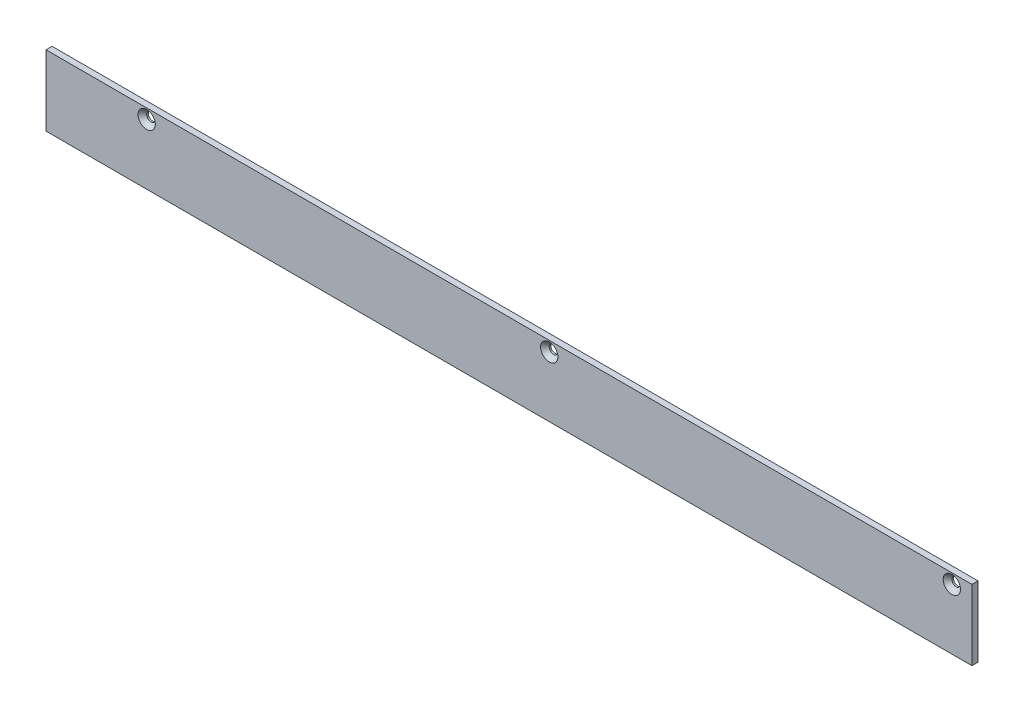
ISO-10303-21;
HEADER;
FILE_DESCRIPTION(('STEP AP214'),'2;1');
FILE_NAME('part.step','',(''),(''),'','','');
FILE_SCHEMA(('AUTOMOTIVE_DESIGN { 1 0 10303 214 1 1 1 1 }'));
ENDSEC;
DATA;
#1=APPLICATION_CONTEXT('core data for automotive mechanical design processes');
#2=APPLICATION_PROTOCOL_DEFINITION('international standard','automotive_design',2000,#1);
#3=PRODUCT_CONTEXT('',#1,'mechanical');
#4=PRODUCT('Part','Part','',(#3));
#5=PRODUCT_RELATED_PRODUCT_CATEGORY('part','',(#4));
#6=PRODUCT_DEFINITION_FORMATION('','',#4);
#7=PRODUCT_DEFINITION_CONTEXT('part definition',#1,'design');
#8=PRODUCT_DEFINITION('design','',#6,#7);
#9=PRODUCT_DEFINITION_SHAPE('','',#8);
#10=(LENGTH_UNIT() NAMED_UNIT(*) SI_UNIT(.MILLI.,.METRE.));
#11=(NAMED_UNIT(*) PLANE_ANGLE_UNIT() SI_UNIT($,.RADIAN.));
#12=(NAMED_UNIT(*) SI_UNIT($,.STERADIAN.) SOLID_ANGLE_UNIT());
#13=UNCERTAINTY_MEASURE_WITH_UNIT(LENGTH_MEASURE(1.E-05),#10,'distance_accuracy_value','');
#14=(GEOMETRIC_REPRESENTATION_CONTEXT(3) GLOBAL_UNCERTAINTY_ASSIGNED_CONTEXT((#13)) GLOBAL_UNIT_ASSIGNED_CONTEXT((#10,
#11,#12)) REPRESENTATION_CONTEXT('',''));
#15=CARTESIAN_POINT('',(0.,0.,0.));
#16=DIRECTION('',(0.,0.,1.));
#17=DIRECTION('',(1.,0.,0.));
#18=AXIS2_PLACEMENT_3D('',#15,#16,#17);
#19=CARTESIAN_POINT('',(4.44089209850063E-13,-1.80411241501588E-13,3.00000000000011));
#20=DIRECTION('',(1.,0.,0.));
#21=DIRECTION('',(0.,0.,-1.00000000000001));
#22=AXIS2_PLACEMENT_3D('',#19,#20,#21);
#23=PLANE('',#22);
#24=DIRECTION('',(0.,-1.,0.));
#25=VECTOR('',#24,1.);
#26=CARTESIAN_POINT('',(0.,0.,0.));
#27=LINE('',#26,#25);
#28=CARTESIAN_POINT('',(0.,34.9999999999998,1.11022302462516E-13));
#29=VERTEX_POINT('',#28);
#30=CARTESIAN_POINT('',(0.,0.,0.));
#31=VERTEX_POINT('',#30);
#32=EDGE_CURVE('E100',#29,#31,#27,.T.);
#33=ORIENTED_EDGE('',*,*,#32,.T.);
#34=DIRECTION('',(0.,0.,-1.00000000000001));
#35=VECTOR('',#34,1.);
#36=CARTESIAN_POINT('',(4.44089209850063E-13,-1.80411241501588E-13,3.00000000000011));
#37=LINE('',#36,#35);
#38=CARTESIAN_POINT('',(4.44089209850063E-13,-1.80411241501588E-13,3.00000000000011));
#39=VERTEX_POINT('',#38);
#40=EDGE_CURVE('E11',#39,#31,#37,.T.);
#41=ORIENTED_EDGE('',*,*,#40,.F.);
#42=DIRECTION('',(0.,-1.,0.));
#43=VECTOR('',#42,1.);
#44=CARTESIAN_POINT('',(4.44089209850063E-13,-1.80411241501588E-13,3.00000000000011));
#45=LINE('',#44,#43);
#46=CARTESIAN_POINT('',(-1.11022302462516E-12,35.0000000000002,3.00000000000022));
#47=VERTEX_POINT('',#46);
#48=EDGE_CURVE('E88',#47,#39,#45,.T.);
#49=ORIENTED_EDGE('',*,*,#48,.F.);
#50=DIRECTION('',(0.,0.,-1.00000000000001));
#51=VECTOR('',#50,1.);
#52=CARTESIAN_POINT('',(-1.11022302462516E-12,35.0000000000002,3.00000000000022));
#53=LINE('',#52,#51);
#54=EDGE_CURVE('E96',#47,#29,#53,.T.);
#55=ORIENTED_EDGE('',*,*,#54,.T.);
#56=EDGE_LOOP('',(#33,#41,#49,#55));
#57=FACE_BOUND('',#56,.T.);
#58=ADVANCED_FACE('F36',(#57),#23,.F.);
#59=CARTESIAN_POINT('',(4.44089209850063E-13,-1.80411241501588E-13,3.00000000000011));
#60=DIRECTION('',(0.,1.,0.));
#61=DIRECTION('',(0.,0.,1.00000000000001));
#62=AXIS2_PLACEMENT_3D('',#59,#60,#61);
#63=PLANE('',#62);
#64=DIRECTION('',(1.,0.,0.));
#65=VECTOR('',#64,1.);
#66=CARTESIAN_POINT('',(0.,0.,0.));
#67=LINE('',#66,#65);
#68=CARTESIAN_POINT('',(459.999999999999,0.,-1.11022302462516E-13));
#69=VERTEX_POINT('',#68);
#70=EDGE_CURVE('E92',#31,#69,#67,.T.);
#71=ORIENTED_EDGE('',*,*,#70,.T.);
#72=DIRECTION('',(0.,0.,-1.00000000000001));
#73=VECTOR('',#72,1.);
#74=CARTESIAN_POINT('',(460.,0.,3.));
#75=LINE('',#74,#73);
#76=CARTESIAN_POINT('',(460.,0.,3.));
#77=VERTEX_POINT('',#76);
#78=EDGE_CURVE('E45',#77,#69,#75,.T.);
#79=ORIENTED_EDGE('',*,*,#78,.F.);
#80=DIRECTION('',(1.,0.,0.));
#81=VECTOR('',#80,1.);
#82=CARTESIAN_POINT('',(4.44089209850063E-13,-1.80411241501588E-13,3.00000000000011));
#83=LINE('',#82,#81);
#84=EDGE_CURVE('E83',#39,#77,#83,.T.);
#85=ORIENTED_EDGE('',*,*,#84,.F.);
#86=ORIENTED_EDGE('',*,*,#40,.T.);
#87=EDGE_LOOP('',(#71,#79,#85,#86));
#88=FACE_BOUND('',#87,.T.);
#89=ADVANCED_FACE('F91',(#88),#63,.F.);
#90=CARTESIAN_POINT('',(460.,0.,3.));
#91=DIRECTION('',(-1.,0.,0.));
#92=DIRECTION('',(0.,0.,1.00000000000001));
#93=AXIS2_PLACEMENT_3D('',#90,#91,#92);
#94=PLANE('',#93);
#95=DIRECTION('',(0.,1.,0.));
#96=VECTOR('',#95,1.);
#97=CARTESIAN_POINT('',(459.999999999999,0.,-1.11022302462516E-13));
#98=LINE('',#97,#96);
#99=CARTESIAN_POINT('',(460.,35.0000000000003,1.11022302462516E-12));
#100=VERTEX_POINT('',#99);
#101=EDGE_CURVE('E70',#69,#100,#98,.T.);
#102=ORIENTED_EDGE('',*,*,#101,.T.);
#103=DIRECTION('',(0.,0.,-1.00000000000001));
#104=VECTOR('',#103,1.);
#105=CARTESIAN_POINT('',(459.999999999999,35.0000000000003,2.99999999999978));
#106=LINE('',#105,#104);
#107=CARTESIAN_POINT('',(459.999999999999,35.0000000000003,2.99999999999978));
#108=VERTEX_POINT('',#107);
#109=EDGE_CURVE('E93',#108,#100,#106,.T.);
#110=ORIENTED_EDGE('',*,*,#109,.F.);
#111=DIRECTION('',(0.,1.,0.));
#112=VECTOR('',#111,1.);
#113=CARTESIAN_POINT('',(460.,0.,3.));
#114=LINE('',#113,#112);
#115=EDGE_CURVE('E86',#77,#108,#114,.T.);
#116=ORIENTED_EDGE('',*,*,#115,.F.);
#117=ORIENTED_EDGE('',*,*,#78,.T.);
#118=EDGE_LOOP('',(#102,#110,#116,#117));
#119=FACE_BOUND('',#118,.T.);
#120=ADVANCED_FACE('F94',(#119),#94,.F.);
#121=CARTESIAN_POINT('',(-1.11022302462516E-12,35.0000000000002,3.00000000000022));
#122=DIRECTION('',(0.,-1.,0.));
#123=DIRECTION('',(0.,0.,-1.00000000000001));
#124=AXIS2_PLACEMENT_3D('',#121,#122,#123);
#125=PLANE('',#124);
#126=DIRECTION('',(-1.,0.,0.));
#127=VECTOR('',#126,1.);
#128=CARTESIAN_POINT('',(0.,34.9999999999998,1.11022302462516E-13));
#129=LINE('',#128,#127);
#130=EDGE_CURVE('E76',#100,#29,#129,.T.);
#131=ORIENTED_EDGE('',*,*,#130,.T.);
#132=ORIENTED_EDGE('',*,*,#54,.F.);
#133=DIRECTION('',(-1.,0.,0.));
#134=VECTOR('',#133,1.);
#135=CARTESIAN_POINT('',(-1.11022302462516E-12,35.0000000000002,3.00000000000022));
#136=LINE('',#135,#134);
#137=EDGE_CURVE('E53',#108,#47,#136,.T.);
#138=ORIENTED_EDGE('',*,*,#137,.F.);
#139=ORIENTED_EDGE('',*,*,#109,.T.);
#140=EDGE_LOOP('',(#131,#132,#138,#139));
#141=FACE_BOUND('',#140,.T.);
#142=ADVANCED_FACE('F108',(#141),#125,.F.);
#143=CARTESIAN_POINT('',(4.44089209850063E-13,-1.80411241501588E-13,3.00000000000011));
#144=DIRECTION('',(0.,0.,-1.00000000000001));
#145=DIRECTION('',(-1.,0.,0.));
#146=AXIS2_PLACEMENT_3D('',#143,#144,#145);
#147=PLANE('',#146);
#148=CARTESIAN_POINT('',(49.9999999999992,30.,2.99999999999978));
#149=DIRECTION('',(0.,0.,1.00000000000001));
#150=DIRECTION('',(1.,0.,0.));
#151=AXIS2_PLACEMENT_3D('',#148,#149,#150);
#152=CIRCLE('',#151,4.3);
#153=CARTESIAN_POINT('',(54.2999999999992,30.,2.99999999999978));
#154=VERTEX_POINT('',#153);
#155=EDGE_CURVE('E103',#154,#154,#152,.T.);
#156=ORIENTED_EDGE('',*,*,#155,.F.);
#157=EDGE_LOOP('',(#156));
#158=FACE_BOUND('',#157,.T.);
#159=CARTESIAN_POINT('',(249.999999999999,30.0000000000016,3.00000000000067));
#160=DIRECTION('',(0.,0.,1.00000000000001));
#161=DIRECTION('',(1.,0.,0.));
#162=AXIS2_PLACEMENT_3D('',#159,#160,#161);
#163=CIRCLE('',#162,4.30000000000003);
#164=CARTESIAN_POINT('',(254.299999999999,30.0000000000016,3.00000000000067));
#165=VERTEX_POINT('',#164);
#166=EDGE_CURVE('E117',#165,#165,#163,.T.);
#167=ORIENTED_EDGE('',*,*,#166,.F.);
#168=EDGE_LOOP('',(#167));
#169=FACE_BOUND('',#168,.T.);
#170=CARTESIAN_POINT('',(449.999999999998,30.0000000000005,3.000000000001));
#171=DIRECTION('',(0.,0.,1.00000000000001));
#172=DIRECTION('',(1.,0.,0.));
#173=AXIS2_PLACEMENT_3D('',#170,#171,#172);
#174=CIRCLE('',#173,4.29999999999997);
#175=CARTESIAN_POINT('',(454.299999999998,30.0000000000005,3.000000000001));
#176=VERTEX_POINT('',#175);
#177=EDGE_CURVE('E114',#176,#176,#174,.T.);
#178=ORIENTED_EDGE('',*,*,#177,.F.);
#179=EDGE_LOOP('',(#178));
#180=FACE_BOUND('',#179,.T.);
#181=ORIENTED_EDGE('',*,*,#48,.T.);
#182=ORIENTED_EDGE('',*,*,#84,.T.);
#183=ORIENTED_EDGE('',*,*,#115,.T.);
#184=ORIENTED_EDGE('',*,*,#137,.T.);
#185=EDGE_LOOP('',(#181,#182,#183,#184));
#186=FACE_BOUND('',#185,.T.);
#187=ADVANCED_FACE('F84',(#158,#169,#180,#186),#147,.F.);
#188=CARTESIAN_POINT('',(0.,0.,0.));
#189=DIRECTION('',(0.,0.,-1.00000000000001));
#190=DIRECTION('',(-1.,0.,0.));
#191=AXIS2_PLACEMENT_3D('',#188,#189,#190);
#192=PLANE('',#191);
#193=CARTESIAN_POINT('',(450.,29.9999999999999,1.11022302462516E-13));
#194=DIRECTION('',(0.,0.,1.00000000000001));
#195=DIRECTION('',(1.,0.,0.));
#196=AXIS2_PLACEMENT_3D('',#193,#194,#195);
#197=CIRCLE('',#196,2.14999999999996);
#198=CARTESIAN_POINT('',(452.15,29.9999999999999,1.11022302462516E-13));
#199=VERTEX_POINT('',#198);
#200=EDGE_CURVE('E132',#199,#199,#197,.T.);
#201=ORIENTED_EDGE('',*,*,#200,.T.);
#202=EDGE_LOOP('',(#201));
#203=FACE_BOUND('',#202,.T.);
#204=CARTESIAN_POINT('',(249.999999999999,30.000000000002,8.88178419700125E-13));
#205=DIRECTION('',(0.,0.,1.00000000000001));
#206=DIRECTION('',(1.,0.,0.));
#207=AXIS2_PLACEMENT_3D('',#204,#205,#206);
#208=CIRCLE('',#207,2.15000000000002);
#209=CARTESIAN_POINT('',(252.149999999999,30.000000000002,8.88178419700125E-13));
#210=VERTEX_POINT('',#209);
#211=EDGE_CURVE('E126',#210,#210,#208,.T.);
#212=ORIENTED_EDGE('',*,*,#211,.T.);
#213=EDGE_LOOP('',(#212));
#214=FACE_BOUND('',#213,.T.);
#215=CARTESIAN_POINT('',(49.9999999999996,30.0000000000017,7.7715611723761E-13));
#216=DIRECTION('',(0.,0.,1.00000000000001));
#217=DIRECTION('',(1.,0.,0.));
#218=AXIS2_PLACEMENT_3D('',#215,#216,#217);
#219=CIRCLE('',#218,2.14999999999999);
#220=CARTESIAN_POINT('',(52.1499999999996,30.0000000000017,7.7715611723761E-13));
#221=VERTEX_POINT('',#220);
#222=EDGE_CURVE('E118',#221,#221,#219,.T.);
#223=ORIENTED_EDGE('',*,*,#222,.T.);
#224=EDGE_LOOP('',(#223));
#225=FACE_BOUND('',#224,.T.);
#226=ORIENTED_EDGE('',*,*,#32,.F.);
#227=ORIENTED_EDGE('',*,*,#130,.F.);
#228=ORIENTED_EDGE('',*,*,#101,.F.);
#229=ORIENTED_EDGE('',*,*,#70,.F.);
#230=EDGE_LOOP('',(#226,#227,#228,#229));
#231=FACE_BOUND('',#230,.T.);
#232=ADVANCED_FACE('F111',(#203,#214,#225,#231),#192,.T.);
#233=CARTESIAN_POINT('',(449.999999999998,30.0000000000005,3.000000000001));
#234=DIRECTION('',(0.,0.,1.00000000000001));
#235=DIRECTION('',(1.,0.,0.));
#236=AXIS2_PLACEMENT_3D('',#233,#234,#235);
#237=CONICAL_SURFACE('',#236,4.29999999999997,0.78539816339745);
#238=CARTESIAN_POINT('',(449.999999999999,30.0000000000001,0.850000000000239));
#239=DIRECTION('',(0.,0.,1.00000000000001));
#240=DIRECTION('',(1.,0.,0.));
#241=AXIS2_PLACEMENT_3D('',#238,#239,#240);
#242=CIRCLE('',#241,2.14999999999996);
#243=CARTESIAN_POINT('',(452.149999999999,30.0000000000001,0.850000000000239));
#244=VERTEX_POINT('',#243);
#245=EDGE_CURVE('E135',#244,#244,#242,.T.);
#246=ORIENTED_EDGE('',*,*,#245,.F.);
#247=EDGE_LOOP('',(#246));
#248=FACE_BOUND('',#247,.T.);
#249=ORIENTED_EDGE('',*,*,#177,.T.);
#250=EDGE_LOOP('',(#249));
#251=FACE_BOUND('',#250,.T.);
#252=ADVANCED_FACE('F150',(#248,#251),#237,.F.);
#253=CARTESIAN_POINT('',(249.999999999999,30.0000000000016,3.00000000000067));
#254=DIRECTION('',(0.,0.,1.00000000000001));
#255=DIRECTION('',(1.,0.,0.));
#256=AXIS2_PLACEMENT_3D('',#253,#254,#255);
#257=CONICAL_SURFACE('',#256,4.30000000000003,0.78539816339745);
#258=CARTESIAN_POINT('',(249.999999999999,29.9999999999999,0.85000000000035));
#259=DIRECTION('',(0.,0.,1.00000000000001));
#260=DIRECTION('',(1.,0.,0.));
#261=AXIS2_PLACEMENT_3D('',#258,#259,#260);
#262=CIRCLE('',#261,2.15000000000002);
#263=CARTESIAN_POINT('',(252.149999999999,29.9999999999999,0.85000000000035));
#264=VERTEX_POINT('',#263);
#265=EDGE_CURVE('E129',#264,#264,#262,.T.);
#266=ORIENTED_EDGE('',*,*,#265,.F.);
#267=EDGE_LOOP('',(#266));
#268=FACE_BOUND('',#267,.T.);
#269=ORIENTED_EDGE('',*,*,#166,.T.);
#270=EDGE_LOOP('',(#269));
#271=FACE_BOUND('',#270,.T.);
#272=ADVANCED_FACE('F153',(#268,#271),#257,.F.);
#273=CARTESIAN_POINT('',(49.9999999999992,30.,2.99999999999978));
#274=DIRECTION('',(0.,0.,1.00000000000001));
#275=DIRECTION('',(1.,0.,0.));
#276=AXIS2_PLACEMENT_3D('',#273,#274,#275);
#277=CONICAL_SURFACE('',#276,4.3,0.78539816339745);
#278=CARTESIAN_POINT('',(49.9999999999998,30.,0.849999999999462));
#279=DIRECTION('',(0.,0.,1.00000000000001));
#280=DIRECTION('',(1.,0.,0.));
#281=AXIS2_PLACEMENT_3D('',#278,#279,#280);
#282=CIRCLE('',#281,2.14999999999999);
#283=CARTESIAN_POINT('',(52.1499999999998,30.,0.849999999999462));
#284=VERTEX_POINT('',#283);
#285=EDGE_CURVE('E123',#284,#284,#282,.T.);
#286=ORIENTED_EDGE('',*,*,#285,.F.);
#287=EDGE_LOOP('',(#286));
#288=FACE_BOUND('',#287,.T.);
#289=ORIENTED_EDGE('',*,*,#155,.T.);
#290=EDGE_LOOP('',(#289));
#291=FACE_BOUND('',#290,.T.);
#292=ADVANCED_FACE('F38',(#288,#291),#277,.F.);
#293=CARTESIAN_POINT('',(49.9999999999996,30.0000000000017,7.7715611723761E-13));
#294=DIRECTION('',(0.,0.,1.00000000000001));
#295=DIRECTION('',(1.,0.,0.));
#296=AXIS2_PLACEMENT_3D('',#293,#294,#295);
#297=CYLINDRICAL_SURFACE('',#296,2.14999999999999);
#298=ORIENTED_EDGE('',*,*,#222,.F.);
#299=EDGE_LOOP('',(#298));
#300=FACE_BOUND('',#299,.T.);
#301=ORIENTED_EDGE('',*,*,#285,.T.);
#302=EDGE_LOOP('',(#301));
#303=FACE_BOUND('',#302,.T.);
#304=ADVANCED_FACE('F181',(#300,#303),#297,.F.);
#305=CARTESIAN_POINT('',(249.999999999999,30.000000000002,8.88178419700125E-13));
#306=DIRECTION('',(0.,0.,1.00000000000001));
#307=DIRECTION('',(1.,0.,0.));
#308=AXIS2_PLACEMENT_3D('',#305,#306,#307);
#309=CYLINDRICAL_SURFACE('',#308,2.15000000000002);
#310=ORIENTED_EDGE('',*,*,#211,.F.);
#311=EDGE_LOOP('',(#310));
#312=FACE_BOUND('',#311,.T.);
#313=ORIENTED_EDGE('',*,*,#265,.T.);
#314=EDGE_LOOP('',(#313));
#315=FACE_BOUND('',#314,.T.);
#316=ADVANCED_FACE('F146',(#312,#315),#309,.F.);
#317=CARTESIAN_POINT('',(450.,29.9999999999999,1.11022302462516E-13));
#318=DIRECTION('',(0.,0.,1.00000000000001));
#319=DIRECTION('',(1.,0.,0.));
#320=AXIS2_PLACEMENT_3D('',#317,#318,#319);
#321=CYLINDRICAL_SURFACE('',#320,2.14999999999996);
#322=ORIENTED_EDGE('',*,*,#200,.F.);
#323=EDGE_LOOP('',(#322));
#324=FACE_BOUND('',#323,.T.);
#325=ORIENTED_EDGE('',*,*,#245,.T.);
#326=EDGE_LOOP('',(#325));
#327=FACE_BOUND('',#326,.T.);
#328=ADVANCED_FACE('F143',(#324,#327),#321,.F.);
#329=CLOSED_SHELL('',(#58,#89,#120,#142,#187,#232,#252,#272,#292,#304,#316,#328));
#330=MANIFOLD_SOLID_BREP('B2',#329);
#331=ADVANCED_BREP_SHAPE_REPRESENTATION('',(#18,#330),#14);
#332=SHAPE_DEFINITION_REPRESENTATION(#9,#331);
ENDSEC;
END-ISO-10303-21;
